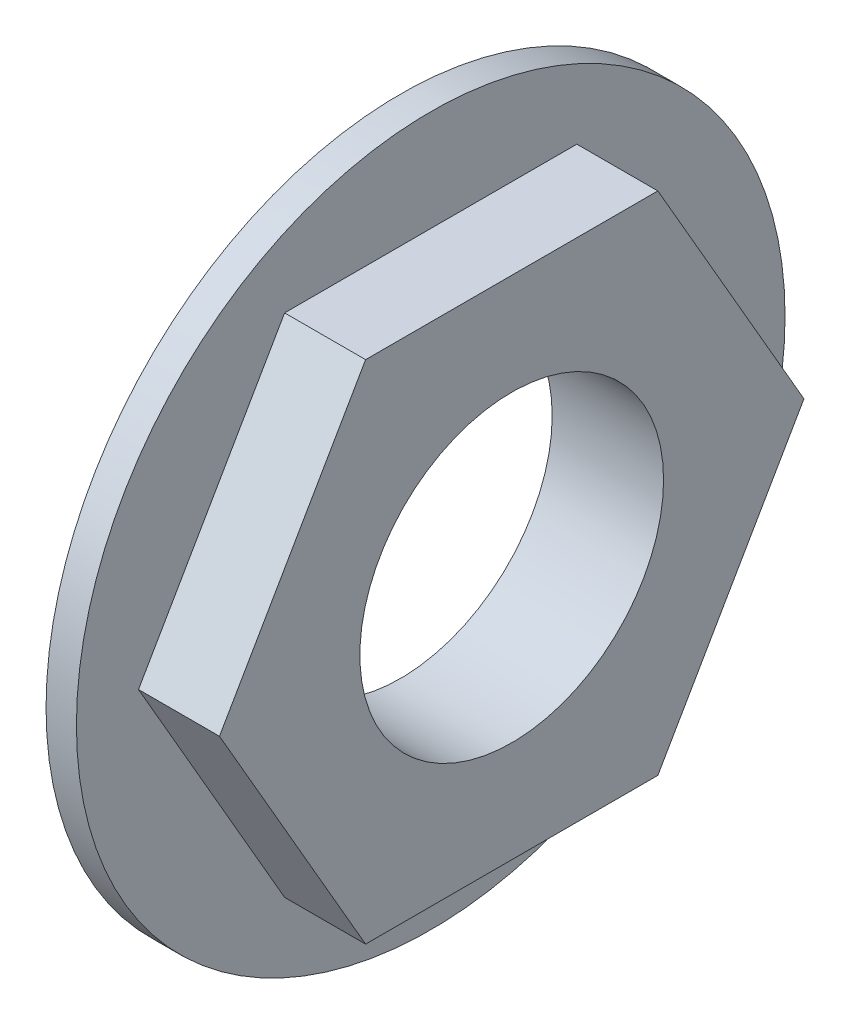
from build123d import *

# Parameters (mm, degrees)
SKETCH2_R           = 22.225
BOSS_EXTRUDE1_DEPTH = 1.905
BOSS_EXTRUDE2_DEPTH = 5.08
SKETCH3_R           = 9.525
CUT_EXTRUDE1_DEPTH  = 6.35


with BuildPart() as part:
    # Sketch2 → Boss-Extrude1 (new body)
    with BuildSketch(Plane(origin=(0, 0, 0), x_dir=(0, 0, -1), z_dir=(1, 0, 0))):
        with Locations(Location((0, 0, 0), (0, 0, 180))):
            Circle(SKETCH2_R)
    extrude(amount=BOSS_EXTRUDE1_DEPTH)

    # Sketch4 → Boss-Extrude2 (add)
    with BuildSketch(Plane(origin=(1.905, 0, 0), x_dir=(0, 0, -1), z_dir=(1, 0, 0))):
        Polygon((18.330871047, 0), (9.165435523, 15.875), (-9.165435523, 15.875), (-18.330871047, 0), (-9.165435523, -15.875), (9.165435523, -15.875), align=None)
    extrude(amount=BOSS_EXTRUDE2_DEPTH)

    # Sketch3 → Cut-Extrude1 (cut, symmetric)
    with BuildSketch(Plane(origin=(1.905, 0, 0), x_dir=(0, 0, -1), z_dir=(1, 0, 0))):
        Circle(SKETCH3_R)
    extrude(amount=CUT_EXTRUDE1_DEPTH, both=True, mode=Mode.SUBTRACT)


solid = part.part
